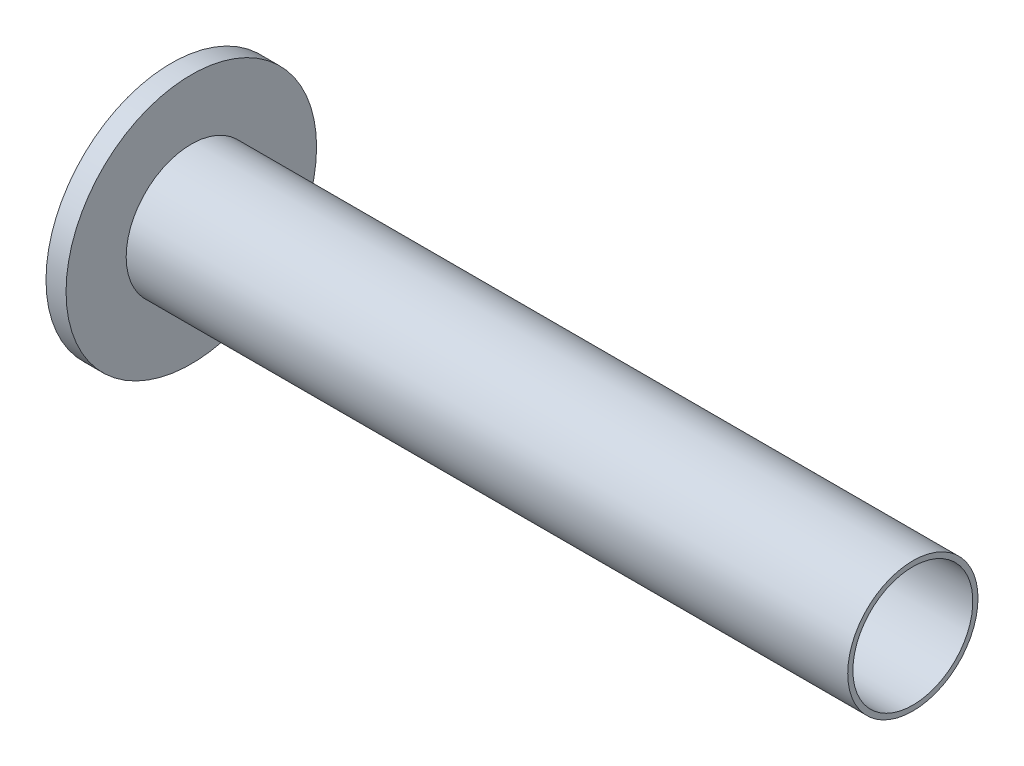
from build123d import *

# Parameters (mm, degrees)
SKETCH1_R          = 20.6375
EXTRUDE1_DEPTH     = 228.6
SKETCH2_R          = 39.6875
EXTRUDE2_DEPTH     = 6.35
SKETCH3_R          = 18.9992
CUT_EXTRUDE1_DEPTH = 242.560960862


with BuildPart() as part:
    # Sketch1 → Extrude1 (new body)
    with BuildSketch(Plane(origin=(0, 0, 0), x_dir=(0, 0, -1), z_dir=(1, 0, 0))):
        Circle(SKETCH1_R)
    extrude(amount=EXTRUDE1_DEPTH)

    # Sketch2 → Extrude2 (add)
    with BuildSketch(Plane.ZY):
        Circle(SKETCH2_R)
    extrude(amount=EXTRUDE2_DEPTH)

    # Sketch3 → Cut-Extrude1 (cut, through all)
    with BuildSketch(Plane.ZY.offset(6.35)):
        Circle(SKETCH3_R)
    extrude(amount=-CUT_EXTRUDE1_DEPTH, mode=Mode.SUBTRACT)


solid = part.part
